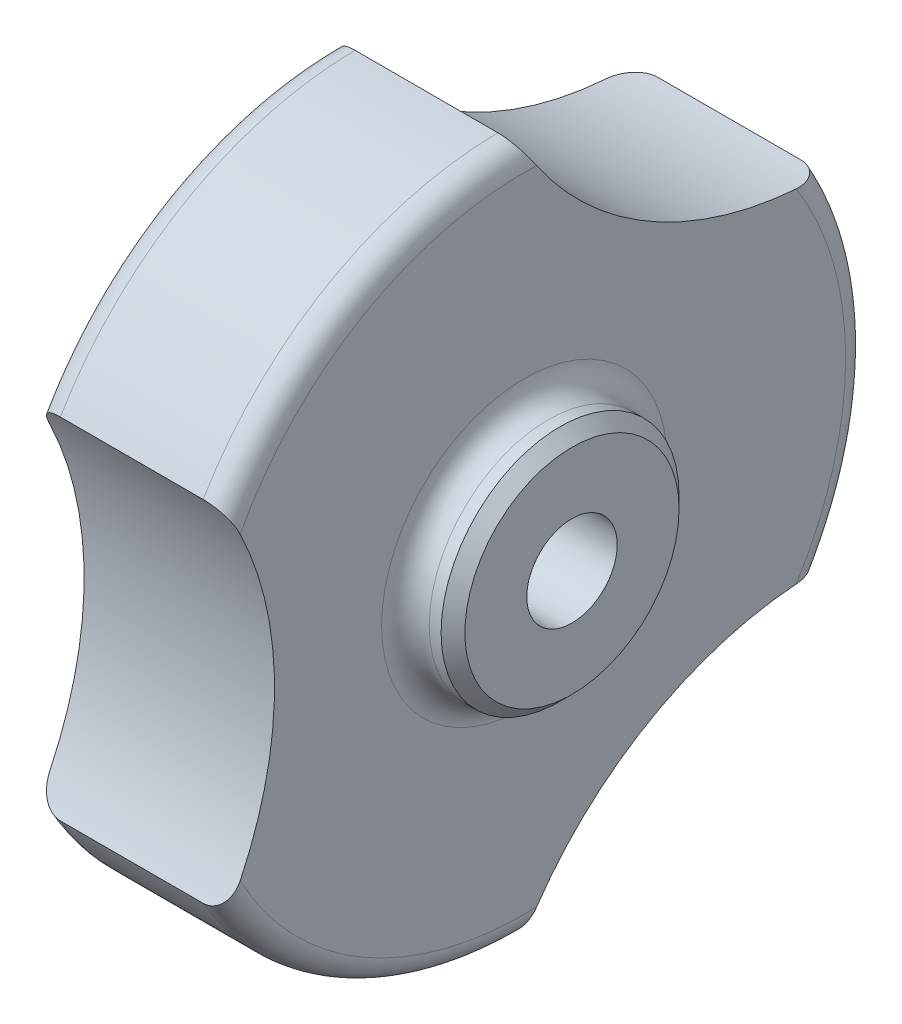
ISO-10303-21;
HEADER;
FILE_DESCRIPTION(('STEP AP214'),'2;1');
FILE_NAME('part.step','',(''),(''),'','','');
FILE_SCHEMA(('AUTOMOTIVE_DESIGN { 1 0 10303 214 1 1 1 1 }'));
ENDSEC;
DATA;
#1=APPLICATION_CONTEXT('core data for automotive mechanical design processes');
#2=APPLICATION_PROTOCOL_DEFINITION('international standard','automotive_design',2000,#1);
#3=PRODUCT_CONTEXT('',#1,'mechanical');
#4=PRODUCT('Part','Part','',(#3));
#5=PRODUCT_RELATED_PRODUCT_CATEGORY('part','',(#4));
#6=PRODUCT_DEFINITION_FORMATION('','',#4);
#7=PRODUCT_DEFINITION_CONTEXT('part definition',#1,'design');
#8=PRODUCT_DEFINITION('design','',#6,#7);
#9=PRODUCT_DEFINITION_SHAPE('','',#8);
#10=(LENGTH_UNIT() NAMED_UNIT(*) SI_UNIT(.MILLI.,.METRE.));
#11=(NAMED_UNIT(*) PLANE_ANGLE_UNIT() SI_UNIT($,.RADIAN.));
#12=(NAMED_UNIT(*) SI_UNIT($,.STERADIAN.) SOLID_ANGLE_UNIT());
#13=UNCERTAINTY_MEASURE_WITH_UNIT(LENGTH_MEASURE(1.E-05),#10,'distance_accuracy_value','');
#14=(GEOMETRIC_REPRESENTATION_CONTEXT(3) GLOBAL_UNCERTAINTY_ASSIGNED_CONTEXT((#13)) GLOBAL_UNIT_ASSIGNED_CONTEXT((#10,
#11,#12)) REPRESENTATION_CONTEXT('',''));
#15=CARTESIAN_POINT('',(0.,0.,0.));
#16=DIRECTION('',(0.,0.,1.));
#17=DIRECTION('',(1.,0.,0.));
#18=AXIS2_PLACEMENT_3D('',#15,#16,#17);
#19=CARTESIAN_POINT('',(8.,14.5,0.));
#20=DIRECTION('',(-1.,0.,0.));
#21=DIRECTION('',(0.,0.,1.));
#22=AXIS2_PLACEMENT_3D('',#19,#20,#21);
#23=PLANE('',#22);
#24=CARTESIAN_POINT('',(8.,0.,0.));
#25=DIRECTION('',(-1.,0.,0.));
#26=DIRECTION('',(0.,0.,1.));
#27=AXIS2_PLACEMENT_3D('',#24,#25,#26);
#28=CIRCLE('',#27,6.);
#29=CARTESIAN_POINT('',(8.,0.,6.));
#30=VERTEX_POINT('',#29);
#31=EDGE_CURVE('E345',#30,#30,#28,.T.);
#32=ORIENTED_EDGE('',*,*,#31,.T.);
#33=EDGE_LOOP('',(#32));
#34=FACE_BOUND('',#33,.T.);
#35=CARTESIAN_POINT('',(8.,0.,0.));
#36=DIRECTION('',(-1.,0.,0.));
#37=DIRECTION('',(0.,0.,1.));
#38=AXIS2_PLACEMENT_3D('',#35,#36,#37);
#39=CIRCLE('',#38,13.5);
#40=CARTESIAN_POINT('',(8.,-6.29971427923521,11.94));
#41=VERTEX_POINT('',#40);
#42=CARTESIAN_POINT('',(8.,-13.4902004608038,-0.514287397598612));
#43=VERTEX_POINT('',#42);
#44=EDGE_CURVE('E235',#41,#43,#39,.F.);
#45=ORIENTED_EDGE('',*,*,#44,.T.);
#46=CARTESIAN_POINT('',(8.,-21.6506350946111,-12.4999999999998));
#47=DIRECTION('',(-1.,0.,0.));
#48=DIRECTION('',(0.,0.,1.));
#49=AXIS2_PLACEMENT_3D('',#46,#47,#48);
#50=CIRCLE('',#49,14.5);
#51=CARTESIAN_POINT('',(8.00000000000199,-7.19048618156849,-11.4257126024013));
#52=VERTEX_POINT('',#51);
#53=EDGE_CURVE('E149',#43,#52,#50,.T.);
#54=ORIENTED_EDGE('',*,*,#53,.T.);
#55=CARTESIAN_POINT('',(8.,7.19048618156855,-11.4257126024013));
#56=VERTEX_POINT('',#55);
#57=EDGE_CURVE('E238',#52,#56,#39,.F.);
#58=ORIENTED_EDGE('',*,*,#57,.T.);
#59=CARTESIAN_POINT('',(8.,21.6506350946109,-12.5000000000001));
#60=DIRECTION('',(-1.,0.,0.));
#61=DIRECTION('',(0.,0.,1.));
#62=AXIS2_PLACEMENT_3D('',#59,#60,#61);
#63=CIRCLE('',#62,14.5);
#64=CARTESIAN_POINT('',(8.,13.4902004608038,-0.514287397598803));
#65=VERTEX_POINT('',#64);
#66=EDGE_CURVE('E299',#56,#65,#63,.T.);
#67=ORIENTED_EDGE('',*,*,#66,.T.);
#68=CARTESIAN_POINT('',(8.,6.29971427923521,11.94));
#69=VERTEX_POINT('',#68);
#70=EDGE_CURVE('E239',#65,#69,#39,.F.);
#71=ORIENTED_EDGE('',*,*,#70,.T.);
#72=CARTESIAN_POINT('',(8.,0.,25.));
#73=DIRECTION('',(-1.,0.,0.));
#74=DIRECTION('',(0.,0.,1.));
#75=AXIS2_PLACEMENT_3D('',#72,#73,#74);
#76=CIRCLE('',#75,14.5);
#77=EDGE_CURVE('E288',#69,#41,#76,.T.);
#78=ORIENTED_EDGE('',*,*,#77,.T.);
#79=EDGE_LOOP('',(#45,#54,#58,#67,#71,#78));
#80=FACE_BOUND('',#79,.T.);
#81=ADVANCED_FACE('F32',(#34,#80),#23,.F.);
#82=CARTESIAN_POINT('',(0.,0.,0.));
#83=DIRECTION('',(-1.,0.,0.));
#84=DIRECTION('',(0.,0.,1.));
#85=AXIS2_PLACEMENT_3D('',#82,#83,#84);
#86=CYLINDRICAL_SURFACE('',#85,14.5);
#87=CARTESIAN_POINT('',(1.,0.,0.));
#88=DIRECTION('',(1.,0.,0.));
#89=DIRECTION('',(0.,0.,-1.));
#90=AXIS2_PLACEMENT_3D('',#87,#88,#89);
#91=CIRCLE('',#90,14.5);
#92=CARTESIAN_POINT('',(1.,-7.34846922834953,12.5));
#93=VERTEX_POINT('',#92);
#94=CARTESIAN_POINT('',(1.,-14.4995521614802,0.113961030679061));
#95=VERTEX_POINT('',#94);
#96=EDGE_CURVE('E257',#93,#95,#91,.T.);
#97=ORIENTED_EDGE('',*,*,#96,.T.);
#98=DIRECTION('',(-1.,0.,0.));
#99=VECTOR('',#98,1.);
#100=CARTESIAN_POINT('',(4.0539386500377,-14.4995521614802,0.113961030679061));
#101=LINE('',#100,#99);
#102=CARTESIAN_POINT('',(6.99999999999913,-14.4995521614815,0.113961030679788));
#103=VERTEX_POINT('',#102);
#104=EDGE_CURVE('E310',#95,#103,#101,.F.);
#105=ORIENTED_EDGE('',*,*,#104,.T.);
#106=CARTESIAN_POINT('',(7.,0.,0.));
#107=DIRECTION('',(-1.,0.,0.));
#108=DIRECTION('',(0.,0.,1.));
#109=AXIS2_PLACEMENT_3D('',#106,#107,#108);
#110=CIRCLE('',#109,14.5);
#111=CARTESIAN_POINT('',(7.,-7.34846922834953,12.5));
#112=VERTEX_POINT('',#111);
#113=EDGE_CURVE('E251',#103,#112,#110,.T.);
#114=ORIENTED_EDGE('',*,*,#113,.T.);
#115=DIRECTION('',(-1.,0.,0.));
#116=VECTOR('',#115,1.);
#117=CARTESIAN_POINT('',(4.,-7.34846922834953,12.5));
#118=LINE('',#117,#116);
#119=EDGE_CURVE('E286',#112,#93,#118,.T.);
#120=ORIENTED_EDGE('',*,*,#119,.T.);
#121=EDGE_LOOP('',(#97,#105,#114,#120));
#122=FACE_BOUND('',#121,.T.);
#123=ADVANCED_FACE('F338',(#122),#86,.T.);
#124=CARTESIAN_POINT('',(7.,0.,0.));
#125=DIRECTION('',(-1.,0.,0.));
#126=DIRECTION('',(0.,0.,1.));
#127=AXIS2_PLACEMENT_3D('',#124,#125,#126);
#128=TOROIDAL_SURFACE('',#127,13.5,1.);
#129=CARTESIAN_POINT('',(6.91709230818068,-12.4351380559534,-1.30515233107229));
#130=CARTESIAN_POINT('',(6.9385392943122,-12.4331712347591,-1.3067718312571));
#131=CARTESIAN_POINT('',(6.96009352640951,-12.4319683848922,-1.30776239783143));
#132=CARTESIAN_POINT('',(7.00324393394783,-12.4310982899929,-1.30847895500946));
#133=CARTESIAN_POINT('',(7.02484008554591,-12.4314303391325,-1.30820552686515));
#134=CARTESIAN_POINT('',(7.08907590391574,-12.4347188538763,-1.30549687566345));
#135=CARTESIAN_POINT('',(7.13155364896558,-12.4399323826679,-1.30120236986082));
#136=CARTESIAN_POINT('',(7.21458214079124,-12.455966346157,-1.28803455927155));
#137=CARTESIAN_POINT('',(7.25513540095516,-12.4667792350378,-1.27916741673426));
#138=CARTESIAN_POINT('',(7.33358066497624,-12.4932568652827,-1.25754849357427));
#139=CARTESIAN_POINT('',(7.37146723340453,-12.5089311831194,-1.24478904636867));
#140=CARTESIAN_POINT('',(7.45722583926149,-12.5507358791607,-1.21094384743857));
#141=CARTESIAN_POINT('',(7.50372189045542,-12.5785959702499,-1.18851740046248));
#142=CARTESIAN_POINT('',(7.59038613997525,-12.639978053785,-1.13955944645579));
#143=CARTESIAN_POINT('',(7.63054088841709,-12.67351177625,-1.1130194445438));
#144=CARTESIAN_POINT('',(7.71739359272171,-12.7572638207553,-1.0474170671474));
#145=CARTESIAN_POINT('',(7.76152942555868,-12.8092346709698,-1.00720442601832));
#146=CARTESIAN_POINT('',(7.83867715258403,-12.9186743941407,-0.923834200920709));
#147=CARTESIAN_POINT('',(7.87168214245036,-12.9761466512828,-0.880674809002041));
#148=CARTESIAN_POINT('',(7.9272097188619,-13.0961878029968,-0.792006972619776));
#149=CARTESIAN_POINT('',(7.9495202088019,-13.1588330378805,-0.746469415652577));
#150=CARTESIAN_POINT('',(7.98245629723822,-13.2868859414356,-0.655005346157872));
#151=CARTESIAN_POINT('',(7.99307664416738,-13.3522948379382,-0.60907866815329));
#152=CARTESIAN_POINT('',(8.00258860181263,-13.492455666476,-0.512415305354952));
#153=CARTESIAN_POINT('',(7.99991259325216,-13.567383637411,-0.461765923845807));
#154=CARTESIAN_POINT('',(7.9780132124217,-13.7164805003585,-0.362984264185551));
#155=CARTESIAN_POINT('',(7.9588131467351,-13.7906503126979,-0.314848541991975));
#156=CARTESIAN_POINT('',(7.91027376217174,-13.9158790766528,-0.235109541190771));
#157=CARTESIAN_POINT('',(7.88495634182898,-13.9678644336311,-0.202499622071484));
#158=CARTESIAN_POINT('',(7.82460172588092,-14.0680217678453,-0.140492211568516));
#159=CARTESIAN_POINT('',(7.78956854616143,-14.116195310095,-0.111093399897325));
#160=CARTESIAN_POINT('',(7.70963168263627,-14.2070922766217,-0.0562660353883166));
#161=CARTESIAN_POINT('',(7.66465350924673,-14.2497705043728,-0.0308700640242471));
#162=CARTESIAN_POINT('',(7.56580599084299,-14.326920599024,0.0146001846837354));
#163=CARTESIAN_POINT('',(7.51194472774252,-14.3613998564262,0.0346792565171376));
#164=CARTESIAN_POINT('',(7.40494111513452,-14.4158926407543,0.066199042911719));
#165=CARTESIAN_POINT('',(7.35271525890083,-14.4372422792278,0.0784472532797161));
#166=CARTESIAN_POINT('',(7.24454993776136,-14.4709572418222,0.0977223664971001));
#167=CARTESIAN_POINT('',(7.18861581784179,-14.4833352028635,0.104756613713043));
#168=CARTESIAN_POINT('',(7.09636744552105,-14.4955627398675,0.111699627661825));
#169=CARTESIAN_POINT('',(7.06053911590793,-14.4983665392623,0.113289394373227));
#170=CARTESIAN_POINT('',(6.98877511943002,-14.5001323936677,0.114289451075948));
#171=CARTESIAN_POINT('',(6.95283951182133,-14.4990962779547,0.113700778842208));
#172=CARTESIAN_POINT('',(6.91709230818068,-14.4961244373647,0.112017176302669));
#173=B_SPLINE_CURVE_WITH_KNOTS('',3,(#129,#130,#131,#132,#133,#134,#135,#136,#137,#138,#139,
#140,#141,#142,#143,#144,#145,#146,#147,#148,#149,#150,#151,#152,#153,#154,#155,#156,#157,#158,
#159,#160,#161,#162,#163,#164,#165,#166,#167,#168,#169,#170,#171,#172),.UNSPECIFIED.,.F.,.F.,(4,
2,2,2,2,2,2,2,2,2,2,2,2,2,2,2,2,2,2,2,2,4),(0.,0.0647499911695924,0.129470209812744,
0.257748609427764,0.385854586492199,0.514214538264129,0.689230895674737,0.864613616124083,
1.10083458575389,1.33720181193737,1.57808047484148,1.81906730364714,2.08909467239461,
2.35874180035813,2.55710945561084,2.75539524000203,2.95521980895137,3.15486356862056,
3.32709842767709,3.49909021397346,3.60675775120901,3.71437400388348),.UNSPECIFIED.);
#174=EDGE_CURVE('E311',#43,#103,#173,.T.);
#175=ORIENTED_EDGE('',*,*,#174,.F.);
#176=ORIENTED_EDGE('',*,*,#44,.F.);
#177=CARTESIAN_POINT('',(6.9998,-7.34846920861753,12.4999999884));
#178=CARTESIAN_POINT('',(7.02522254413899,-7.34847506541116,12.5000039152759));
#179=CARTESIAN_POINT('',(7.05063232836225,-7.34752208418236,12.4994431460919));
#180=CARTESIAN_POINT('',(7.10125349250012,-7.34371718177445,12.4972073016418));
#181=CARTESIAN_POINT('',(7.12646492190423,-7.34086575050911,12.4955325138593));
#182=CARTESIAN_POINT('',(7.2013399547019,-7.32952479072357,12.4888790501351));
#183=CARTESIAN_POINT('',(7.25047289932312,-7.31824824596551,12.4822710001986));
#184=CARTESIAN_POINT('',(7.34578809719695,-7.2887301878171,12.4650608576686));
#185=CARTESIAN_POINT('',(7.39197183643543,-7.2704922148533,12.4544607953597));
#186=CARTESIAN_POINT('',(7.48035298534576,-7.22774892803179,12.4297870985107));
#187=CARTESIAN_POINT('',(7.52254818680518,-7.20324016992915,12.4157115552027));
#188=CARTESIAN_POINT('',(7.60372094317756,-7.14769816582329,12.3840787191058));
#189=CARTESIAN_POINT('',(7.6424973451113,-7.11643976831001,12.3664029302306));
#190=CARTESIAN_POINT('',(7.71423588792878,-7.0490726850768,12.32869128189));
#191=CARTESIAN_POINT('',(7.74719588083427,-7.01296221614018,12.3086545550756));
#192=CARTESIAN_POINT('',(7.81051478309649,-6.93242773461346,12.2644674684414));
#193=CARTESIAN_POINT('',(7.84011893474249,-6.88752534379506,12.2401100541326));
#194=CARTESIAN_POINT('',(7.89165657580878,-6.79416868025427,12.1901568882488));
#195=CARTESIAN_POINT('',(7.9135862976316,-6.74571267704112,12.1645605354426));
#196=CARTESIAN_POINT('',(7.95275862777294,-6.63863486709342,12.1088129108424));
#197=CARTESIAN_POINT('',(7.96874662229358,-6.57960204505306,12.0785709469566));
#198=CARTESIAN_POINT('',(7.99114794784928,-6.45970330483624,12.0182146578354));
#199=CARTESIAN_POINT('',(7.9975564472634,-6.39883647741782,11.9881004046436));
#200=CARTESIAN_POINT('',(8.00160114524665,-6.26623859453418,11.9236647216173));
#201=CARTESIAN_POINT('',(7.99759486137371,-6.19438967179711,11.889479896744));
#202=CARTESIAN_POINT('',(7.97787804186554,-6.05141285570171,11.8228743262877));
#203=CARTESIAN_POINT('',(7.96215276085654,-5.98028598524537,11.7904558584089));
#204=CARTESIAN_POINT('',(7.916831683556,-5.83194126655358,11.7242393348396));
#205=CARTESIAN_POINT('',(7.88579136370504,-5.75502383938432,11.6907466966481));
#206=CARTESIAN_POINT('',(7.80962762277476,-5.60675313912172,11.6276112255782));
#207=CARTESIAN_POINT('',(7.76452180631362,-5.5353930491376,11.5979636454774));
#208=CARTESIAN_POINT('',(7.67718048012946,-5.42399860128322,11.5525991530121));
#209=CARTESIAN_POINT('',(7.63891252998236,-5.38139947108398,11.5355143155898));
#210=CARTESIAN_POINT('',(7.55575929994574,-5.30202692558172,11.5040628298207));
#211=CARTESIAN_POINT('',(7.51088431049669,-5.26524463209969,11.4896920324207));
#212=CARTESIAN_POINT('',(7.42526882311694,-5.2069640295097,11.4671406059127));
#213=CARTESIAN_POINT('',(7.38578633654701,-5.18388325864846,11.4582936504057));
#214=CARTESIAN_POINT('',(7.30337322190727,-5.14401574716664,11.443099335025));
#215=CARTESIAN_POINT('',(7.26045220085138,-5.12721216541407,11.4367452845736));
#216=CARTESIAN_POINT('',(7.18138551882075,-5.10394573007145,11.4279748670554));
#217=CARTESIAN_POINT('',(7.14572317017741,-5.09604851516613,11.4250103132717));
#218=CARTESIAN_POINT('',(7.07333076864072,-5.08536784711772,11.4210072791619));
#219=CARTESIAN_POINT('',(7.03659571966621,-5.08261434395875,11.419980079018));
#220=CARTESIAN_POINT('',(6.9998,-5.08267648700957,11.42000001));
#221=B_SPLINE_CURVE_WITH_KNOTS('',3,(#177,#178,#179,#180,#181,#182,#183,#184,#185,#186,#187,
#188,#189,#190,#191,#192,#193,#194,#195,#196,#197,#198,#199,#200,#201,#202,#203,#204,#205,#206,
#207,#208,#209,#210,#211,#212,#213,#214,#215,#216,#217,#218,#219,#220),.UNSPECIFIED.,.F.,.F.,(4,
2,2,2,2,2,2,2,2,2,2,2,2,2,2,2,2,2,2,2,2,4),(0.,0.0762178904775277,0.152416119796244,
0.304136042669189,0.455778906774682,0.607505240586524,0.765413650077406,0.923380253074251,
1.0998173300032,1.27634090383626,1.48024483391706,1.6842515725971,1.92230465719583,
2.16065777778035,2.42776701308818,2.69454326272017,2.8732562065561,3.05169369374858,
3.19092469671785,3.32977942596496,3.43931100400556,3.54947838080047),.UNSPECIFIED.);
#222=EDGE_CURVE('E269',#112,#41,#221,.T.);
#223=ORIENTED_EDGE('',*,*,#222,.F.);
#224=ORIENTED_EDGE('',*,*,#113,.F.);
#225=EDGE_LOOP('',(#175,#176,#223,#224));
#226=FACE_BOUND('',#225,.T.);
#227=ADVANCED_FACE('F334',(#226),#128,.T.);
#228=CARTESIAN_POINT('',(1.,0.,0.));
#229=DIRECTION('',(1.,0.,0.));
#230=DIRECTION('',(0.,0.,-1.));
#231=AXIS2_PLACEMENT_3D('',#228,#229,#230);
#232=TOROIDAL_SURFACE('',#231,13.5,1.);
#233=CARTESIAN_POINT('',(1.10807730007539,-14.4937201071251,0.110652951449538));
#234=CARTESIAN_POINT('',(1.0832466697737,-14.4964090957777,0.112178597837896));
#235=CARTESIAN_POINT('',(1.05829508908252,-14.4981706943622,0.113177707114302));
#236=CARTESIAN_POINT('',(1.00831347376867,-14.4998290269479,0.114118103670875));
#237=CARTESIAN_POINT('',(0.983283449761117,-14.4997260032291,0.11405952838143));
#238=CARTESIAN_POINT('',(0.908493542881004,-14.4966131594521,0.112294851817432));
#239=CARTESIAN_POINT('',(0.858850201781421,-14.4908192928,0.109010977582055));
#240=CARTESIAN_POINT('',(0.761426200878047,-14.472060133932,0.0983401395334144));
#241=CARTESIAN_POINT('',(0.713645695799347,-14.4590942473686,0.0909528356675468));
#242=CARTESIAN_POINT('',(0.621169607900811,-14.4265856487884,0.0723290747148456));
#243=CARTESIAN_POINT('',(0.576474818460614,-14.4070412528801,0.0610916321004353));
#244=CARTESIAN_POINT('',(0.490132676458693,-14.3616346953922,0.0347985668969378));
#245=CARTESIAN_POINT('',(0.448589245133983,-14.3356270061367,0.0196546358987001));
#246=CARTESIAN_POINT('',(0.3705824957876,-14.2785733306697,-0.0138557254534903));
#247=CARTESIAN_POINT('',(0.334121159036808,-14.2475253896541,-0.0322234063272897));
#248=CARTESIAN_POINT('',(0.263484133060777,-14.1782193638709,-0.0736255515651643));
#249=CARTESIAN_POINT('',(0.22987360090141,-14.139553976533,-0.0969399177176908));
#250=CARTESIAN_POINT('',(0.169608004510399,-14.0587057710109,-0.146261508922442));
#251=CARTESIAN_POINT('',(0.142955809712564,-14.0165215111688,-0.172269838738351));
#252=CARTESIAN_POINT('',(0.0933142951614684,-13.9236088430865,-0.230262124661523));
#253=CARTESIAN_POINT('',(0.0713836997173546,-13.8725181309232,-0.262570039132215));
#254=CARTESIAN_POINT('',(0.0363386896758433,-13.7686706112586,-0.329196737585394));
#255=CARTESIAN_POINT('',(0.0232290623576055,-13.7159129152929,-0.363516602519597));
#256=CARTESIAN_POINT('',(0.0039514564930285,-13.6010174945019,-0.4393556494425));
#257=CARTESIAN_POINT('',(-0.000690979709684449,-13.5387851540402,-0.481119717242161));
#258=CARTESIAN_POINT('',(0.000857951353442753,-13.4150569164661,-0.565559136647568));
#259=CARTESIAN_POINT('',(0.0070587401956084,-13.3535617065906,-0.608235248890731));
#260=CARTESIAN_POINT('',(0.0314661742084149,-13.2235003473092,-0.699973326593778));
#261=CARTESIAN_POINT('',(0.0513221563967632,-13.1552438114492,-0.749040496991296));
#262=CARTESIAN_POINT('',(0.104209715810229,-13.0229549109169,-0.845822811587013));
#263=CARTESIAN_POINT('',(0.137241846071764,-12.9589227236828,-0.893537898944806));
#264=CARTESIAN_POINT('',(0.209185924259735,-12.8482484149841,-0.977331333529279));
#265=CARTESIAN_POINT('',(0.245899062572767,-12.8005739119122,-1.01393586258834));
#266=CARTESIAN_POINT('',(0.328329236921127,-12.7107742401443,-1.08369146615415));
#267=CARTESIAN_POINT('',(0.374032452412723,-12.6686407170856,-1.11684772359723));
#268=CARTESIAN_POINT('',(0.461097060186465,-12.6023018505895,-1.16955612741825));
#269=CARTESIAN_POINT('',(0.500334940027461,-12.5763190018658,-1.19037182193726));
#270=CARTESIAN_POINT('',(0.583580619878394,-12.5296114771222,-1.22800704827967));
#271=CARTESIAN_POINT('',(0.627580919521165,-12.508878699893,-1.24483273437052));
#272=CARTESIAN_POINT('',(0.711578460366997,-12.4771236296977,-1.27070646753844));
#273=CARTESIAN_POINT('',(0.750906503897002,-12.4650322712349,-1.28060390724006));
#274=CARTESIAN_POINT('',(0.831611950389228,-12.446116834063,-1.29611697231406));
#275=CARTESIAN_POINT('',(0.872986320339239,-12.4392851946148,-1.30173874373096));
#276=CARTESIAN_POINT('',(0.946848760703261,-12.4323353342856,-1.30745928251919));
#277=CARTESIAN_POINT('',(0.979154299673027,-12.4310214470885,-1.30854161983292));
#278=CARTESIAN_POINT('',(1.04377711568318,-12.4318199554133,-1.30788530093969));
#279=CARTESIAN_POINT('',(1.07609420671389,-12.4339412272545,-1.30613933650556));
#280=CARTESIAN_POINT('',(1.10807730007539,-12.4377953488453,-1.30296540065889));
#281=B_SPLINE_CURVE_WITH_KNOTS('',3,(#233,#234,#235,#236,#237,#238,#239,#240,#241,#242,#243,
#244,#245,#246,#247,#248,#249,#250,#251,#252,#253,#254,#255,#256,#257,#258,#259,#260,#261,#262,
#263,#264,#265,#266,#267,#268,#269,#270,#271,#272,#273,#274,#275,#276,#277,#278,#279,#280),
.UNSPECIFIED.,.F.,.F.,(4,2,2,2,2,2,2,2,2,2,2,2,2,2,2,2,2,2,2,2,2,2,2,4),(0.,0.0750206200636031,
0.150031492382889,0.29950551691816,0.44899193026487,0.598516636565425,0.751773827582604,
0.905090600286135,1.07328539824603,1.24154944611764,1.43372467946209,1.626004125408,
1.85040566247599,2.07500227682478,2.33302240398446,2.59105336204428,2.80162683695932,
3.0118790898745,3.16573647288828,3.31935497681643,3.44579291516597,3.57204876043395,
3.66880381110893,3.76580927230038),.UNSPECIFIED.);
#282=CARTESIAN_POINT('',(0.,-13.4902004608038,-0.514287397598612));
#283=VERTEX_POINT('',#282);
#284=EDGE_CURVE('E174',#95,#283,#281,.T.);
#285=ORIENTED_EDGE('',*,*,#284,.F.);
#286=ORIENTED_EDGE('',*,*,#96,.F.);
#287=CARTESIAN_POINT('',(1.0002,-5.08267648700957,11.42000001));
#288=CARTESIAN_POINT('',(0.977538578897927,-5.08266507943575,11.4199961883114));
#289=CARTESIAN_POINT('',(0.954891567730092,-5.08369436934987,11.4203809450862));
#290=CARTESIAN_POINT('',(0.909827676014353,-5.08777610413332,11.42190949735));
#291=CARTESIAN_POINT('',(0.887410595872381,-5.09082661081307,11.4230525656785));
#292=CARTESIAN_POINT('',(0.821206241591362,-5.10284125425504,11.4275615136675));
#293=CARTESIAN_POINT('',(0.777983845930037,-5.11467110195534,11.432007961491));
#294=CARTESIAN_POINT('',(0.69452382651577,-5.14492065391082,11.4434500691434));
#295=CARTESIAN_POINT('',(0.654276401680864,-5.16331743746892,11.450436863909));
#296=CARTESIAN_POINT('',(0.577108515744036,-5.20551940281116,11.4665938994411));
#297=CARTESIAN_POINT('',(0.540197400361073,-5.22933915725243,11.4757700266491));
#298=CARTESIAN_POINT('',(0.454230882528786,-5.29294366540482,11.5005049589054));
#299=CARTESIAN_POINT('',(0.4072101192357,-5.33508263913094,11.5170755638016));
#300=CARTESIAN_POINT('',(0.320986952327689,-5.42558526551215,11.5532377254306));
#301=CARTESIAN_POINT('',(0.281799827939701,-5.47396078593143,11.5728350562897));
#302=CARTESIAN_POINT('',(0.200338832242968,-5.59037071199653,11.620806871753));
#303=CARTESIAN_POINT('',(0.160731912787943,-5.65991834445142,11.6500409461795));
#304=CARTESIAN_POINT('',(0.0942731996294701,-5.80343742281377,11.7118008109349));
#305=CARTESIAN_POINT('',(0.0674267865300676,-5.87741072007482,11.7443279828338));
#306=CARTESIAN_POINT('',(0.0264470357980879,-6.02848968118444,11.8123451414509));
#307=CARTESIAN_POINT('',(0.0124501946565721,-6.10562008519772,11.8478626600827));
#308=CARTESIAN_POINT('',(-0.00171006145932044,-6.26031931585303,11.9207907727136));
#309=CARTESIAN_POINT('',(-0.00186886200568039,-6.33788828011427,11.9582019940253));
#310=CARTESIAN_POINT('',(0.0128265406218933,-6.49386040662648,12.035140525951));
#311=CARTESIAN_POINT('',(0.0281829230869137,-6.5722047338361,12.0746967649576));
#312=CARTESIAN_POINT('',(0.0757745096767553,-6.72400756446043,12.1530169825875));
#313=CARTESIAN_POINT('',(0.107974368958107,-6.79747593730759,12.1917824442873));
#314=CARTESIAN_POINT('',(0.177033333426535,-6.91433081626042,12.2546088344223));
#315=CARTESIAN_POINT('',(0.209346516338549,-6.95997789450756,12.279500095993));
#316=CARTESIAN_POINT('',(0.282093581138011,-7.04577084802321,12.3268195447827));
#317=CARTESIAN_POINT('',(0.322521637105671,-7.08592063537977,12.3492494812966));
#318=CARTESIAN_POINT('',(0.411246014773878,-7.15942135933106,12.3906984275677));
#319=CARTESIAN_POINT('',(0.459594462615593,-7.19272371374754,12.4096929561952));
#320=CARTESIAN_POINT('',(0.562725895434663,-7.25056255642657,12.442911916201));
#321=CARTESIAN_POINT('',(0.617502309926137,-7.27510789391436,12.4571411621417));
#322=CARTESIAN_POINT('',(0.726173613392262,-7.31222687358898,12.4787476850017));
#323=CARTESIAN_POINT('',(0.779642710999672,-7.32572778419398,12.486653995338));
#324=CARTESIAN_POINT('',(0.861406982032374,-7.3393295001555,12.494630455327));
#325=CARTESIAN_POINT('',(0.889003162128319,-7.34275530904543,12.4966422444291));
#326=CARTESIAN_POINT('',(0.944460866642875,-7.34732927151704,12.499329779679));
#327=CARTESIAN_POINT('',(0.972322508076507,-7.34847636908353,12.5000049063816));
#328=CARTESIAN_POINT('',(1.0002,-7.34846920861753,12.4999999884));
#329=B_SPLINE_CURVE_WITH_KNOTS('',3,(#287,#288,#289,#290,#291,#292,#293,#294,#295,#296,#297,
#298,#299,#300,#301,#302,#303,#304,#305,#306,#307,#308,#309,#310,#311,#312,#313,#314,#315,#316,
#317,#318,#319,#320,#321,#322,#323,#324,#325,#326,#327,#328),.UNSPECIFIED.,.F.,.F.,(4,2,2,2,2,2,
2,2,2,2,2,2,2,2,2,2,2,2,2,2,4),(0.,0.0679297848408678,0.135794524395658,0.270101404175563,
0.403944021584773,0.538150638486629,0.732909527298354,0.928044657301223,1.18234826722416,
1.43675901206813,1.69384201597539,1.95101074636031,2.21677863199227,2.48199104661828,
2.66491063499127,2.84769936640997,3.03174333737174,3.21560079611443,3.38170146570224,
3.46523178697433,3.5488008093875),.UNSPECIFIED.);
#330=CARTESIAN_POINT('',(0.,-6.29971427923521,11.94));
#331=VERTEX_POINT('',#330);
#332=EDGE_CURVE('E192',#331,#93,#329,.T.);
#333=ORIENTED_EDGE('',*,*,#332,.F.);
#334=CARTESIAN_POINT('',(0.,0.,0.));
#335=DIRECTION('',(1.,0.,0.));
#336=DIRECTION('',(0.,0.,-1.));
#337=AXIS2_PLACEMENT_3D('',#334,#335,#336);
#338=CIRCLE('',#337,13.5);
#339=EDGE_CURVE('E230',#283,#331,#338,.F.);
#340=ORIENTED_EDGE('',*,*,#339,.F.);
#341=EDGE_LOOP('',(#285,#286,#333,#340));
#342=FACE_BOUND('',#341,.T.);
#343=ADVANCED_FACE('F186',(#342),#232,.T.);
#344=CARTESIAN_POINT('',(7.,7.15108293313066,-12.613961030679));
#345=VERTEX_POINT('',#344);
#346=CARTESIAN_POINT('',(7.,-7.15108293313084,-12.6139610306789));
#347=VERTEX_POINT('',#346);
#348=EDGE_CURVE('E250',#345,#347,#110,.T.);
#349=ORIENTED_EDGE('',*,*,#348,.T.);
#350=DIRECTION('',(-1.,0.,0.));
#351=VECTOR('',#350,1.);
#352=CARTESIAN_POINT('',(4.0539386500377,-7.15108293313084,-12.6139610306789));
#353=LINE('',#352,#351);
#354=CARTESIAN_POINT('',(1.,-7.15108293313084,-12.6139610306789));
#355=VERTEX_POINT('',#354);
#356=EDGE_CURVE('E136',#347,#355,#353,.T.);
#357=ORIENTED_EDGE('',*,*,#356,.T.);
#358=CARTESIAN_POINT('',(1.,7.15108293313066,-12.613961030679));
#359=VERTEX_POINT('',#358);
#360=EDGE_CURVE('E55',#355,#359,#91,.T.);
#361=ORIENTED_EDGE('',*,*,#360,.T.);
#362=DIRECTION('',(-1.,0.,0.));
#363=VECTOR('',#362,1.);
#364=CARTESIAN_POINT('',(4.0539386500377,7.15108293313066,-12.613961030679));
#365=LINE('',#364,#363);
#366=EDGE_CURVE('E306',#359,#345,#365,.F.);
#367=ORIENTED_EDGE('',*,*,#366,.T.);
#368=EDGE_LOOP('',(#349,#357,#361,#367));
#369=FACE_BOUND('',#368,.T.);
#370=ADVANCED_FACE('F322',(#369),#86,.T.);
#371=CARTESIAN_POINT('',(6.89192269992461,14.4937201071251,0.110652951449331));
#372=CARTESIAN_POINT('',(6.91675333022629,14.4964090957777,0.11217859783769));
#373=CARTESIAN_POINT('',(6.94170491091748,14.4981706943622,0.113177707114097));
#374=CARTESIAN_POINT('',(6.99168652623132,14.4998290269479,0.114118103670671));
#375=CARTESIAN_POINT('',(7.01671655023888,14.4997260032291,0.114059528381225));
#376=CARTESIAN_POINT('',(7.09150645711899,14.4966131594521,0.112294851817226));
#377=CARTESIAN_POINT('',(7.14114979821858,14.4908192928,0.109010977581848));
#378=CARTESIAN_POINT('',(7.23857379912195,14.472060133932,0.0983401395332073));
#379=CARTESIAN_POINT('',(7.28635430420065,14.4590942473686,0.0909528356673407));
#380=CARTESIAN_POINT('',(7.37883039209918,14.4265856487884,0.0723290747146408));
#381=CARTESIAN_POINT('',(7.42352518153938,14.4070412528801,0.0610916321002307));
#382=CARTESIAN_POINT('',(7.5098673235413,14.3616346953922,0.0347985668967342));
#383=CARTESIAN_POINT('',(7.55141075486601,14.3356270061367,0.0196546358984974));
#384=CARTESIAN_POINT('',(7.6294175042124,14.2785733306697,-0.0138557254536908));
#385=CARTESIAN_POINT('',(7.66587884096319,14.2475253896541,-0.0322234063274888));
#386=CARTESIAN_POINT('',(7.73651586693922,14.1782193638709,-0.0736255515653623));
#387=CARTESIAN_POINT('',(7.77012639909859,14.139553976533,-0.0969399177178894));
#388=CARTESIAN_POINT('',(7.8303919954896,14.0587057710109,-0.14626150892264));
#389=CARTESIAN_POINT('',(7.85704419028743,14.0165215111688,-0.172269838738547));
#390=CARTESIAN_POINT('',(7.90668570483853,13.9236088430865,-0.230262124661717));
#391=CARTESIAN_POINT('',(7.92861630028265,13.8725181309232,-0.262570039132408));
#392=CARTESIAN_POINT('',(7.96366131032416,13.7686706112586,-0.329196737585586));
#393=CARTESIAN_POINT('',(7.97677093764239,13.7159129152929,-0.363516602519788));
#394=CARTESIAN_POINT('',(7.99604854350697,13.6010174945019,-0.43935564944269));
#395=CARTESIAN_POINT('',(8.00069097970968,13.5387851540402,-0.48111971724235));
#396=CARTESIAN_POINT('',(7.99914204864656,13.4150569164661,-0.565559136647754));
#397=CARTESIAN_POINT('',(7.99294125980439,13.3535617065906,-0.608235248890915));
#398=CARTESIAN_POINT('',(7.96853382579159,13.2235003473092,-0.699973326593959));
#399=CARTESIAN_POINT('',(7.94867784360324,13.1552438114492,-0.749040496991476));
#400=CARTESIAN_POINT('',(7.89579028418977,13.0229549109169,-0.845822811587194));
#401=CARTESIAN_POINT('',(7.86275815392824,12.9589227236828,-0.893537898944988));
#402=CARTESIAN_POINT('',(7.79081407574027,12.8482484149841,-0.97733133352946));
#403=CARTESIAN_POINT('',(7.75410093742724,12.8005739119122,-1.01393586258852));
#404=CARTESIAN_POINT('',(7.67167076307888,12.7107742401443,-1.08369146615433));
#405=CARTESIAN_POINT('',(7.62596754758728,12.6686407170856,-1.1168477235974));
#406=CARTESIAN_POINT('',(7.53890293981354,12.6023018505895,-1.16955612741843));
#407=CARTESIAN_POINT('',(7.49966505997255,12.5763190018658,-1.19037182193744));
#408=CARTESIAN_POINT('',(7.41641938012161,12.5296114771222,-1.22800704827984));
#409=CARTESIAN_POINT('',(7.37241908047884,12.508878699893,-1.2448327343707));
#410=CARTESIAN_POINT('',(7.28842153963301,12.4771236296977,-1.27070646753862));
#411=CARTESIAN_POINT('',(7.249093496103,12.4650322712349,-1.28060390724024));
#412=CARTESIAN_POINT('',(7.16838804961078,12.446116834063,-1.29611697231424));
#413=CARTESIAN_POINT('',(7.12701367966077,12.4392851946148,-1.30173874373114));
#414=CARTESIAN_POINT('',(7.05315123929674,12.4323353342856,-1.30745928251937));
#415=CARTESIAN_POINT('',(7.02084570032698,12.4310214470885,-1.3085416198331));
#416=CARTESIAN_POINT('',(6.95622288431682,12.4318199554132,-1.30788530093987));
#417=CARTESIAN_POINT('',(6.9239057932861,12.4339412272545,-1.30613933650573));
#418=CARTESIAN_POINT('',(6.89192269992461,12.4377953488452,-1.30296540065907));
#419=B_SPLINE_CURVE_WITH_KNOTS('',3,(#371,#372,#373,#374,#375,#376,#377,#378,#379,#380,#381,
#382,#383,#384,#385,#386,#387,#388,#389,#390,#391,#392,#393,#394,#395,#396,#397,#398,#399,#400,
#401,#402,#403,#404,#405,#406,#407,#408,#409,#410,#411,#412,#413,#414,#415,#416,#417,#418),
.UNSPECIFIED.,.F.,.F.,(4,2,2,2,2,2,2,2,2,2,2,2,2,2,2,2,2,2,2,2,2,2,2,4),(0.,0.0750206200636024,
0.150031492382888,0.29950551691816,0.44899193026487,0.598516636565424,0.751773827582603,
0.905090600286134,1.07328539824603,1.24154944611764,1.43372467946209,1.626004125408,
1.85040566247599,2.07500227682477,2.33302240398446,2.59105336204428,2.80162683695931,
3.0118790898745,3.16573647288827,3.31935497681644,3.44579291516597,3.57204876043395,
3.66880381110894,3.76580927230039),.UNSPECIFIED.);
#420=CARTESIAN_POINT('',(7.,14.4995521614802,0.113961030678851));
#421=VERTEX_POINT('',#420);
#422=EDGE_CURVE('E294',#421,#65,#419,.T.);
#423=ORIENTED_EDGE('',*,*,#422,.F.);
#424=CARTESIAN_POINT('',(7.,7.34846922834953,12.5));
#425=VERTEX_POINT('',#424);
#426=EDGE_CURVE('E245',#425,#421,#110,.T.);
#427=ORIENTED_EDGE('',*,*,#426,.F.);
#428=CARTESIAN_POINT('',(6.9998,5.08267648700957,11.42000001));
#429=CARTESIAN_POINT('',(7.02246142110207,5.08266507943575,11.4199961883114));
#430=CARTESIAN_POINT('',(7.04510843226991,5.08369436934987,11.4203809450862));
#431=CARTESIAN_POINT('',(7.09017232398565,5.08777610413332,11.42190949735));
#432=CARTESIAN_POINT('',(7.11258940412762,5.09082661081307,11.4230525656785));
#433=CARTESIAN_POINT('',(7.17879375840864,5.10284125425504,11.4275615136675));
#434=CARTESIAN_POINT('',(7.22201615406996,5.11467110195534,11.432007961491));
#435=CARTESIAN_POINT('',(7.30547617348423,5.14492065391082,11.4434500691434));
#436=CARTESIAN_POINT('',(7.34572359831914,5.16331743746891,11.450436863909));
#437=CARTESIAN_POINT('',(7.42289148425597,5.20551940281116,11.4665938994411));
#438=CARTESIAN_POINT('',(7.45980259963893,5.22933915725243,11.4757700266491));
#439=CARTESIAN_POINT('',(7.54576911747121,5.29294366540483,11.5005049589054));
#440=CARTESIAN_POINT('',(7.5927898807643,5.33508263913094,11.5170755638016));
#441=CARTESIAN_POINT('',(7.67901304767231,5.42558526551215,11.5532377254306));
#442=CARTESIAN_POINT('',(7.7182001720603,5.47396078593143,11.5728350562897));
#443=CARTESIAN_POINT('',(7.79966116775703,5.59037071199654,11.620806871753));
#444=CARTESIAN_POINT('',(7.83926808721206,5.65991834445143,11.6500409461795));
#445=CARTESIAN_POINT('',(7.90572680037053,5.80343742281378,11.7118008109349));
#446=CARTESIAN_POINT('',(7.93257321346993,5.87741072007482,11.7443279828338));
#447=CARTESIAN_POINT('',(7.97355296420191,6.02848968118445,11.8123451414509));
#448=CARTESIAN_POINT('',(7.98754980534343,6.10562008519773,11.8478626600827));
#449=CARTESIAN_POINT('',(8.00171006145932,6.26031931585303,11.9207907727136));
#450=CARTESIAN_POINT('',(8.00186886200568,6.33788828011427,11.9582019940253));
#451=CARTESIAN_POINT('',(7.98717345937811,6.49386040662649,12.035140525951));
#452=CARTESIAN_POINT('',(7.97181707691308,6.5722047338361,12.0746967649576));
#453=CARTESIAN_POINT('',(7.92422549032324,6.72400756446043,12.1530169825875));
#454=CARTESIAN_POINT('',(7.89202563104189,6.79747593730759,12.1917824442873));
#455=CARTESIAN_POINT('',(7.82296666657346,6.91433081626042,12.2546088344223));
#456=CARTESIAN_POINT('',(7.79065348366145,6.95997789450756,12.279500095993));
#457=CARTESIAN_POINT('',(7.71790641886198,7.04577084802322,12.3268195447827));
#458=CARTESIAN_POINT('',(7.67747836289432,7.08592063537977,12.3492494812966));
#459=CARTESIAN_POINT('',(7.58875398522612,7.15942135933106,12.3906984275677));
#460=CARTESIAN_POINT('',(7.5404055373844,7.19272371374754,12.4096929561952));
#461=CARTESIAN_POINT('',(7.43727410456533,7.25056255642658,12.442911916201));
#462=CARTESIAN_POINT('',(7.38249769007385,7.27510789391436,12.4571411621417));
#463=CARTESIAN_POINT('',(7.27382638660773,7.31222687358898,12.4787476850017));
#464=CARTESIAN_POINT('',(7.22035728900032,7.32572778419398,12.486653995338));
#465=CARTESIAN_POINT('',(7.13859301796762,7.3393295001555,12.494630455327));
#466=CARTESIAN_POINT('',(7.11099683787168,7.34275530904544,12.4966422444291));
#467=CARTESIAN_POINT('',(7.05553913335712,7.34732927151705,12.499329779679));
#468=CARTESIAN_POINT('',(7.02767749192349,7.34847636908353,12.5000049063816));
#469=CARTESIAN_POINT('',(6.9998,7.34846920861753,12.4999999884));
#470=B_SPLINE_CURVE_WITH_KNOTS('',3,(#428,#429,#430,#431,#432,#433,#434,#435,#436,#437,#438,
#439,#440,#441,#442,#443,#444,#445,#446,#447,#448,#449,#450,#451,#452,#453,#454,#455,#456,#457,
#458,#459,#460,#461,#462,#463,#464,#465,#466,#467,#468,#469),.UNSPECIFIED.,.F.,.F.,(4,2,2,2,2,2,
2,2,2,2,2,2,2,2,2,2,2,2,2,2,4),(0.,0.0679297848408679,0.135794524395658,0.270101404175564,
0.403944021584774,0.538150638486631,0.732909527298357,0.928044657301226,1.18234826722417,
1.43675901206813,1.6938420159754,1.95101074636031,2.21677863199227,2.48199104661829,
2.66491063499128,2.84769936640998,3.03174333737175,3.21560079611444,3.38170146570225,
3.46523178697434,3.5488008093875),.UNSPECIFIED.);
#471=EDGE_CURVE('E265',#69,#425,#470,.T.);
#472=ORIENTED_EDGE('',*,*,#471,.F.);
#473=ORIENTED_EDGE('',*,*,#70,.F.);
#474=EDGE_LOOP('',(#423,#427,#472,#473));
#475=FACE_BOUND('',#474,.T.);
#476=ADVANCED_FACE('F327',(#475),#128,.T.);
#477=CARTESIAN_POINT('',(1.10807730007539,12.4377953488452,-1.30296540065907));
#478=CARTESIAN_POINT('',(1.08698612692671,12.4352696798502,-1.3050438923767));
#479=CARTESIAN_POINT('',(1.06575634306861,12.4334802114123,-1.30651725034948));
#480=CARTESIAN_POINT('',(1.0231809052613,12.4313945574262,-1.30823484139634));
#481=CARTESIAN_POINT('',(1.00183528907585,12.4310979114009,-1.30847945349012));
#482=CARTESIAN_POINT('',(0.938203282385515,12.4324691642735,-1.30734960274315));
#483=CARTESIAN_POINT('',(0.895964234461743,12.4363555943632,-1.30414661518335));
#484=CARTESIAN_POINT('',(0.813088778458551,12.4497523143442,-1.29313484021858));
#485=CARTESIAN_POINT('',(0.772451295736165,12.4592587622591,-1.28532919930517));
#486=CARTESIAN_POINT('',(0.693627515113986,12.4832058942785,-1.26574522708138));
#487=CARTESIAN_POINT('',(0.655445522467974,12.4976549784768,-1.25396013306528));
#488=CARTESIAN_POINT('',(0.569876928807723,12.5362129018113,-1.22267289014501));
#489=CARTESIAN_POINT('',(0.523683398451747,12.5619362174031,-1.20190802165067));
#490=CARTESIAN_POINT('',(0.43720217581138,12.6190167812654,-1.15622577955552));
#491=CARTESIAN_POINT('',(0.396927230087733,12.6503858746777,-1.13129968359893));
#492=CARTESIAN_POINT('',(0.309127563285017,12.7292742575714,-1.06922421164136));
#493=CARTESIAN_POINT('',(0.264069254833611,12.7785837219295,-1.03086780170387));
#494=CARTESIAN_POINT('',(0.184543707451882,12.8827777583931,-0.951017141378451));
#495=CARTESIAN_POINT('',(0.150083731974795,12.9376661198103,-0.909520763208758));
#496=CARTESIAN_POINT('',(0.0909551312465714,13.0527221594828,-0.823907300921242));
#497=CARTESIAN_POINT('',(0.0665122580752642,13.1129777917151,-0.77975310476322));
#498=CARTESIAN_POINT('',(0.0286503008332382,13.236432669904,-0.690808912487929));
#499=CARTESIAN_POINT('',(0.0152358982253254,13.2996331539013,-0.646018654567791));
#500=CARTESIAN_POINT('',(-0.00123008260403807,13.4371635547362,-0.550234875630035));
#501=CARTESIAN_POINT('',(-0.00246499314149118,13.5117619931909,-0.499299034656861));
#502=CARTESIAN_POINT('',(0.0112731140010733,13.6608730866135,-0.399515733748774));
#503=CARTESIAN_POINT('',(0.0262278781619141,13.7353857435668,-0.350665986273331));
#504=CARTESIAN_POINT('',(0.0676609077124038,13.8635473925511,-0.268254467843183));
#505=CARTESIAN_POINT('',(0.0904501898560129,13.9178616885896,-0.233864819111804));
#506=CARTESIAN_POINT('',(0.146252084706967,14.0230580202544,-0.1681752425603));
#507=CARTESIAN_POINT('',(0.179261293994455,14.0739411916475,-0.136874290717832));
#508=CARTESIAN_POINT('',(0.25579179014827,14.1706083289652,-0.0781471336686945));
#509=CARTESIAN_POINT('',(0.299396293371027,14.2163475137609,-0.050754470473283));
#510=CARTESIAN_POINT('',(0.39629211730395,14.2997749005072,-0.00131164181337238));
#511=CARTESIAN_POINT('',(0.449572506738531,14.3374720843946,0.0207444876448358));
#512=CARTESIAN_POINT('',(0.555991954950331,14.3977030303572,0.0557165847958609));
#513=CARTESIAN_POINT('',(0.608059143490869,14.4216350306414,0.0694890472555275));
#514=CARTESIAN_POINT('',(0.716523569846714,14.460416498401,0.0917138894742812));
#515=CARTESIAN_POINT('',(0.772915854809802,14.4752761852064,0.100172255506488));
#516=CARTESIAN_POINT('',(0.876016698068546,14.4929437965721,0.110215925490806));
#517=CARTESIAN_POINT('',(0.922313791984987,14.4976095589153,0.112861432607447));
#518=CARTESIAN_POINT('',(1.01524469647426,14.50052409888,0.114510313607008));
#519=CARTESIAN_POINT('',(1.06187892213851,14.498762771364,0.113507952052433));
#520=CARTESIAN_POINT('',(1.10807730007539,14.4937201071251,0.110652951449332));
#521=B_SPLINE_CURVE_WITH_KNOTS('',3,(#477,#478,#479,#480,#481,#482,#483,#484,#485,#486,#487,
#488,#489,#490,#491,#492,#493,#494,#495,#496,#497,#498,#499,#500,#501,#502,#503,#504,#505,#506,
#507,#508,#509,#510,#511,#512,#513,#514,#515,#516,#517,#518,#519,#520),.UNSPECIFIED.,.F.,.F.,(4,
2,2,2,2,2,2,2,2,2,2,2,2,2,2,2,2,2,2,2,2,4),(0.,0.0639894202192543,0.127959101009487,
0.254829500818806,0.381613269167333,0.508613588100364,0.678094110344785,0.847934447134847,
1.07778420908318,1.30779114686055,1.54272913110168,1.77776679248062,2.04741183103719,
2.31675316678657,2.52056275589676,2.7243045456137,2.92970142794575,3.13486769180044,
3.31066054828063,3.4862550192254,3.62550602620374,3.76497606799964),.UNSPECIFIED.);
#522=CARTESIAN_POINT('',(0.,13.4902004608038,-0.514287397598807));
#523=VERTEX_POINT('',#522);
#524=CARTESIAN_POINT('',(1.,14.4995521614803,0.113961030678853));
#525=VERTEX_POINT('',#524);
#526=EDGE_CURVE('E210',#523,#525,#521,.T.);
#527=ORIENTED_EDGE('',*,*,#526,.F.);
#528=CARTESIAN_POINT('',(0.,6.29971427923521,11.94));
#529=VERTEX_POINT('',#528);
#530=EDGE_CURVE('E224',#529,#523,#338,.F.);
#531=ORIENTED_EDGE('',*,*,#530,.F.);
#532=CARTESIAN_POINT('',(1.0002,7.34846920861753,12.4999999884));
#533=CARTESIAN_POINT('',(0.974777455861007,7.34847506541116,12.5000039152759));
#534=CARTESIAN_POINT('',(0.949367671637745,7.34752208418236,12.4994431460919));
#535=CARTESIAN_POINT('',(0.89874650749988,7.34371718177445,12.4972073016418));
#536=CARTESIAN_POINT('',(0.873535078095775,7.34086575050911,12.4955325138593));
#537=CARTESIAN_POINT('',(0.798660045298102,7.32952479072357,12.4888790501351));
#538=CARTESIAN_POINT('',(0.749527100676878,7.31824824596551,12.4822710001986));
#539=CARTESIAN_POINT('',(0.654211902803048,7.2887301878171,12.4650608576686));
#540=CARTESIAN_POINT('',(0.608028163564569,7.2704922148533,12.4544607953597));
#541=CARTESIAN_POINT('',(0.519647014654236,7.22774892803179,12.4297870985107));
#542=CARTESIAN_POINT('',(0.477451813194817,7.20324016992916,12.4157115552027));
#543=CARTESIAN_POINT('',(0.396279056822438,7.14769816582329,12.3840787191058));
#544=CARTESIAN_POINT('',(0.357502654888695,7.11643976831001,12.3664029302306));
#545=CARTESIAN_POINT('',(0.285764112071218,7.0490726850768,12.32869128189));
#546=CARTESIAN_POINT('',(0.252804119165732,7.01296221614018,12.3086545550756));
#547=CARTESIAN_POINT('',(0.189485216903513,6.93242773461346,12.2644674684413));
#548=CARTESIAN_POINT('',(0.15988106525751,6.88752534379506,12.2401100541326));
#549=CARTESIAN_POINT('',(0.108343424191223,6.79416868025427,12.1901568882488));
#550=CARTESIAN_POINT('',(0.0864137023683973,6.74571267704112,12.1645605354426));
#551=CARTESIAN_POINT('',(0.0472413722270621,6.63863486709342,12.1088129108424));
#552=CARTESIAN_POINT('',(0.0312533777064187,6.57960204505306,12.0785709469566));
#553=CARTESIAN_POINT('',(0.00885205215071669,6.45970330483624,12.0182146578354));
#554=CARTESIAN_POINT('',(0.00244355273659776,6.39883647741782,11.9881004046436));
#555=CARTESIAN_POINT('',(-0.00160114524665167,6.26623859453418,11.9236647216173));
#556=CARTESIAN_POINT('',(0.00240513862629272,6.19438967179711,11.889479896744));
#557=CARTESIAN_POINT('',(0.0221219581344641,6.05141285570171,11.8228743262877));
#558=CARTESIAN_POINT('',(0.0378472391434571,5.98028598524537,11.7904558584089));
#559=CARTESIAN_POINT('',(0.0831683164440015,5.83194126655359,11.7242393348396));
#560=CARTESIAN_POINT('',(0.114208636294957,5.75502383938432,11.6907466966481));
#561=CARTESIAN_POINT('',(0.190372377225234,5.60675313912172,11.6276112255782));
#562=CARTESIAN_POINT('',(0.235478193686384,5.53539304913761,11.5979636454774));
#563=CARTESIAN_POINT('',(0.322819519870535,5.42399860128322,11.5525991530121));
#564=CARTESIAN_POINT('',(0.361087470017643,5.38139947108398,11.5355143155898));
#565=CARTESIAN_POINT('',(0.444240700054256,5.30202692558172,11.5040628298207));
#566=CARTESIAN_POINT('',(0.489115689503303,5.26524463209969,11.4896920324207));
#567=CARTESIAN_POINT('',(0.574731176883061,5.2069640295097,11.4671406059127));
#568=CARTESIAN_POINT('',(0.614213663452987,5.18388325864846,11.4582936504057));
#569=CARTESIAN_POINT('',(0.696626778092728,5.14401574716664,11.443099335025));
#570=CARTESIAN_POINT('',(0.739547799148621,5.12721216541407,11.4367452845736));
#571=CARTESIAN_POINT('',(0.818614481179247,5.10394573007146,11.4279748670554));
#572=CARTESIAN_POINT('',(0.854276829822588,5.09604851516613,11.4250103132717));
#573=CARTESIAN_POINT('',(0.926669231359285,5.08536784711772,11.4210072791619));
#574=CARTESIAN_POINT('',(0.963404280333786,5.08261434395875,11.419980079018));
#575=CARTESIAN_POINT('',(1.0002,5.08267648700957,11.42000001));
#576=B_SPLINE_CURVE_WITH_KNOTS('',3,(#532,#533,#534,#535,#536,#537,#538,#539,#540,#541,#542,
#543,#544,#545,#546,#547,#548,#549,#550,#551,#552,#553,#554,#555,#556,#557,#558,#559,#560,#561,
#562,#563,#564,#565,#566,#567,#568,#569,#570,#571,#572,#573,#574,#575),.UNSPECIFIED.,.F.,.F.,(4,
2,2,2,2,2,2,2,2,2,2,2,2,2,2,2,2,2,2,2,2,4),(0.,0.0762178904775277,0.152416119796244,
0.304136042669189,0.45577890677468,0.607505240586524,0.765413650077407,0.923380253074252,
1.0998173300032,1.27634090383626,1.48024483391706,1.6842515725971,1.92230465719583,
2.16065777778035,2.42776701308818,2.69454326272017,2.8732562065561,3.05169369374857,
3.19092469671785,3.32977942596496,3.43931100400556,3.54947838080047),.UNSPECIFIED.);
#577=CARTESIAN_POINT('',(1.,7.34846922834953,12.5));
#578=VERTEX_POINT('',#577);
#579=EDGE_CURVE('E200',#578,#529,#576,.T.);
#580=ORIENTED_EDGE('',*,*,#579,.F.);
#581=EDGE_CURVE('E262',#525,#578,#91,.T.);
#582=ORIENTED_EDGE('',*,*,#581,.F.);
#583=EDGE_LOOP('',(#527,#531,#580,#582));
#584=FACE_BOUND('',#583,.T.);
#585=ADVANCED_FACE('F187',(#584),#232,.T.);
#586=CARTESIAN_POINT('',(0.,0.,0.));
#587=DIRECTION('',(1.,0.,0.));
#588=DIRECTION('',(0.,0.,-1.));
#589=AXIS2_PLACEMENT_3D('',#586,#587,#588);
#590=PLANE('',#589);
#591=CARTESIAN_POINT('',(0.,7.19048618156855,-11.4257126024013));
#592=VERTEX_POINT('',#591);
#593=CARTESIAN_POINT('',(0.,-7.1904861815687,-11.4257126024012));
#594=VERTEX_POINT('',#593);
#595=EDGE_CURVE('E229',#592,#594,#338,.F.);
#596=ORIENTED_EDGE('',*,*,#595,.T.);
#597=CARTESIAN_POINT('',(0.,-21.6506350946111,-12.4999999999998));
#598=DIRECTION('',(-1.,0.,0.));
#599=DIRECTION('',(0.,-0.866025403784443,-0.499999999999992));
#600=AXIS2_PLACEMENT_3D('',#597,#598,#599);
#601=CIRCLE('',#600,14.5);
#602=EDGE_CURVE('E47',#283,#594,#601,.T.);
#603=ORIENTED_EDGE('',*,*,#602,.F.);
#604=ORIENTED_EDGE('',*,*,#339,.T.);
#605=CARTESIAN_POINT('',(0.,0.,25.));
#606=DIRECTION('',(-1.,0.,0.));
#607=DIRECTION('',(0.,0.,1.));
#608=AXIS2_PLACEMENT_3D('',#605,#606,#607);
#609=CIRCLE('',#608,14.5);
#610=EDGE_CURVE('E289',#529,#331,#609,.T.);
#611=ORIENTED_EDGE('',*,*,#610,.F.);
#612=ORIENTED_EDGE('',*,*,#530,.T.);
#613=CARTESIAN_POINT('',(0.,21.6506350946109,-12.5000000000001));
#614=DIRECTION('',(-1.,0.,0.));
#615=DIRECTION('',(0.,0.866025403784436,-0.500000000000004));
#616=AXIS2_PLACEMENT_3D('',#613,#614,#615);
#617=CIRCLE('',#616,14.5);
#618=EDGE_CURVE('E308',#592,#523,#617,.T.);
#619=ORIENTED_EDGE('',*,*,#618,.F.);
#620=EDGE_LOOP('',(#596,#603,#604,#611,#612,#619));
#621=FACE_BOUND('',#620,.T.);
#622=ADVANCED_FACE('F324',(#621),#590,.F.);
#623=ORIENTED_EDGE('',*,*,#426,.T.);
#624=DIRECTION('',(-1.,0.,0.));
#625=VECTOR('',#624,1.);
#626=CARTESIAN_POINT('',(4.0539386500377,14.4995521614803,0.113961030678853));
#627=LINE('',#626,#625);
#628=EDGE_CURVE('E291',#421,#525,#627,.T.);
#629=ORIENTED_EDGE('',*,*,#628,.T.);
#630=ORIENTED_EDGE('',*,*,#581,.T.);
#631=DIRECTION('',(-1.,0.,0.));
#632=VECTOR('',#631,1.);
#633=CARTESIAN_POINT('',(4.,7.34846922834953,12.5));
#634=LINE('',#633,#632);
#635=EDGE_CURVE('E267',#578,#425,#634,.F.);
#636=ORIENTED_EDGE('',*,*,#635,.T.);
#637=EDGE_LOOP('',(#623,#629,#630,#636));
#638=FACE_BOUND('',#637,.T.);
#639=ADVANCED_FACE('F332',(#638),#86,.T.);
#640=CARTESIAN_POINT('',(6.91709230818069,-7.15105249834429,-12.6100206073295));
#641=CARTESIAN_POINT('',(6.94207755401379,-7.15107094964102,-12.6124010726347));
#642=CARTESIAN_POINT('',(6.96715341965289,-7.1510809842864,-12.6137035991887));
#643=CARTESIAN_POINT('',(7.01732031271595,-7.15108433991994,-12.6141494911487));
#644=CARTESIAN_POINT('',(7.04241133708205,-7.15107766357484,-12.6132932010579));
#645=CARTESIAN_POINT('',(7.11727791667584,-7.15103286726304,-12.607496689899));
#646=CARTESIAN_POINT('',(7.16684140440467,-7.15097011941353,-12.5993470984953));
#647=CARTESIAN_POINT('',(7.26385078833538,-7.15082314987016,-12.5748320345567));
#648=CARTESIAN_POINT('',(7.31129680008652,-7.15073892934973,-12.5584670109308));
#649=CARTESIAN_POINT('',(7.40288976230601,-7.15063264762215,-12.5182180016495));
#650=CARTESIAN_POINT('',(7.44703563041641,-7.15061060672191,-12.4943315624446));
#651=CARTESIAN_POINT('',(7.53224066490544,-7.15073577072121,-12.4391904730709));
#652=CARTESIAN_POINT('',(7.57317565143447,-7.15088782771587,-12.4077448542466));
#653=CARTESIAN_POINT('',(7.6497928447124,-7.1514880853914,-12.3390146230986));
#654=CARTESIAN_POINT('',(7.68547302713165,-7.15193639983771,-12.301727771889));
#655=CARTESIAN_POINT('',(7.75449454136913,-7.1533036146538,-12.2184290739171));
#656=CARTESIAN_POINT('',(7.78722785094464,-7.1542657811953,-12.1719154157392));
#657=CARTESIAN_POINT('',(7.84557329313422,-7.15679330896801,-12.0746521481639));
#658=CARTESIAN_POINT('',(7.87118235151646,-7.15835892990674,-12.0239007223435));
#659=CARTESIAN_POINT('',(7.91852707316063,-7.1624452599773,-11.9118407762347));
#660=CARTESIAN_POINT('',(7.93915795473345,-7.16507174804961,-11.8500702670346));
#661=CARTESIAN_POINT('',(7.97142979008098,-7.17126208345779,-11.7242853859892));
#662=CARTESIAN_POINT('',(7.98306593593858,-7.17482643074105,-11.6602698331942));
#663=CARTESIAN_POINT('',(7.99899652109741,-7.18355965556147,-11.5205067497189));
#664=CARTESIAN_POINT('',(8.0017329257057,-7.188897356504,-11.444591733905));
#665=CARTESIAN_POINT('',(7.99617537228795,-7.20073923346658,-11.2932317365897));
#666=CARTESIAN_POINT('',(7.98787095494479,-7.20724451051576,-11.2177872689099));
#667=CARTESIAN_POINT('',(7.95878707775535,-7.22224283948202,-11.0581957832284));
#668=CARTESIAN_POINT('',(7.93638727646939,-7.23088719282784,-10.9743550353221));
#669=CARTESIAN_POINT('',(7.87819261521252,-7.24904756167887,-10.8115161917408));
#670=CARTESIAN_POINT('',(7.84240037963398,-7.25856340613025,-10.7325171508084));
#671=CARTESIAN_POINT('',(7.76670456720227,-7.2757046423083,-10.5987150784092));
#672=CARTESIAN_POINT('',(7.72943745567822,-7.28328541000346,-10.5424122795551));
#673=CARTESIAN_POINT('',(7.64647635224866,-7.29813958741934,-10.4363326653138));
#674=CARTESIAN_POINT('',(7.60079602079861,-7.30541347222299,-10.3865454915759));
#675=CARTESIAN_POINT('',(7.51388012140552,-7.31725016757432,-10.3079162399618));
#676=CARTESIAN_POINT('',(7.47456343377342,-7.3220268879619,-10.2769906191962));
#677=CARTESIAN_POINT('',(7.39144586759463,-7.33071177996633,-10.2217160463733));
#678=CARTESIAN_POINT('',(7.34765136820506,-7.33462116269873,-10.1973579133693));
#679=CARTESIAN_POINT('',(7.26394695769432,-7.34062905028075,-10.1603376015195));
#680=CARTESIAN_POINT('',(7.22461817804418,-7.34292133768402,-10.1463987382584));
#681=CARTESIAN_POINT('',(7.14415717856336,-7.34641872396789,-10.1252342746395));
#682=CARTESIAN_POINT('',(7.10302789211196,-7.34762552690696,-10.117998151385));
#683=CARTESIAN_POINT('',(7.03756534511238,-7.34857442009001,-10.1123099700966));
#684=CARTESIAN_POINT('',(7.01342585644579,-7.34871862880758,-10.1114461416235));
#685=CARTESIAN_POINT('',(6.96517622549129,-7.34859823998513,-10.1121687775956));
#686=CARTESIAN_POINT('',(6.94106609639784,-7.34833349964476,-10.1137560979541));
#687=CARTESIAN_POINT('',(6.91709230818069,-7.34786410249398,-10.116569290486));
#688=B_SPLINE_CURVE_WITH_KNOTS('',3,(#640,#641,#642,#643,#644,#645,#646,#647,#648,#649,#650,
#651,#652,#653,#654,#655,#656,#657,#658,#659,#660,#661,#662,#663,#664,#665,#666,#667,#668,#669,
#670,#671,#672,#673,#674,#675,#676,#677,#678,#679,#680,#681,#682,#683,#684,#685,#686,#687),
.UNSPECIFIED.,.F.,.F.,(4,2,2,2,2,2,2,2,2,2,2,2,2,2,2,2,2,2,2,2,2,2,2,4),(0.,0.0752480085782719,
0.150484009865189,0.300377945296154,0.450263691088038,0.600198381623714,0.754415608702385,
0.908692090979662,1.07867656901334,1.24873428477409,1.44352116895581,1.63841209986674,
1.86597902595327,2.09376168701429,2.35425778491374,2.6147028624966,2.81785492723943,
3.02067999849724,3.17091229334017,3.32093347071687,3.4457831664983,3.57043652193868,
3.64278539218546,3.71515953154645),.UNSPECIFIED.);
#689=EDGE_CURVE('E142',#347,#52,#688,.T.);
#690=ORIENTED_EDGE('',*,*,#689,.F.);
#691=ORIENTED_EDGE('',*,*,#348,.F.);
#692=CARTESIAN_POINT('',(6.89192269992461,7.34729881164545,-10.1199640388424));
#693=CARTESIAN_POINT('',(6.91301387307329,7.34783600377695,-10.1167374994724));
#694=CARTESIAN_POINT('',(6.93424365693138,7.3482172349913,-10.1144510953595));
#695=CARTESIAN_POINT('',(6.9768190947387,7.34866188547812,-10.1117860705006));
#696=CARTESIAN_POINT('',(6.99816471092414,7.34872540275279,-10.1114068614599));
#697=CARTESIAN_POINT('',(7.06179671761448,7.34843254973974,-10.1131593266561));
#698=CARTESIAN_POINT('',(7.10403576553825,7.3476018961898,-10.1181265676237));
#699=CARTESIAN_POINT('',(7.18691122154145,7.34476377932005,-10.135234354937));
#700=CARTESIAN_POINT('',(7.22754870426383,7.34275711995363,-10.1473700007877));
#701=CARTESIAN_POINT('',(7.30637248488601,7.33777046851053,-10.1779008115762));
#702=CARTESIAN_POINT('',(7.34455447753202,7.33478881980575,-10.1963066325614));
#703=CARTESIAN_POINT('',(7.43012307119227,7.32697223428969,-10.2453423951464));
#704=CARTESIAN_POINT('',(7.47631660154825,7.32185098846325,-10.2780018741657));
#705=CARTESIAN_POINT('',(7.56279782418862,7.31082928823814,-10.3502762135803));
#706=CARTESIAN_POINT('',(7.60307276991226,7.30492720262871,-10.3899056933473));
#707=CARTESIAN_POINT('',(7.69087243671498,7.29061245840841,-10.4892627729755));
#708=CARTESIAN_POINT('',(7.73593074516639,7.28204956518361,-10.5511442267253));
#709=CARTESIAN_POINT('',(7.81545629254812,7.26499388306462,-10.6813042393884));
#710=CARTESIAN_POINT('',(7.8499162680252,7.25650114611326,-10.7495871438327));
#711=CARTESIAN_POINT('',(7.90904486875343,7.23988573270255,-10.8920353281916));
#712=CARTESIAN_POINT('',(7.93348774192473,7.23177489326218,-10.9662953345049));
#713=CARTESIAN_POINT('',(7.97134969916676,7.21647440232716,-11.1176824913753));
#714=CARTESIAN_POINT('',(7.98476410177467,7.20928514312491,-11.1948108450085));
#715=CARTESIAN_POINT('',(8.00123008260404,7.1950991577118,-11.361807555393));
#716=CARTESIAN_POINT('',(8.00246499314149,7.18828664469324,-11.451879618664));
#717=CARTESIAN_POINT('',(7.98872688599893,7.17642731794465,-11.6309052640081));
#718=CARTESIAN_POINT('',(7.97377212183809,7.17137852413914,-11.7198599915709));
#719=CARTESIAN_POINT('',(7.9323390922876,7.16408888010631,-11.8720569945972));
#720=CARTESIAN_POINT('',(7.90954981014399,7.16146371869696,-11.9362893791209));
#721=CARTESIAN_POINT('',(7.85374791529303,7.15717304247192,-12.0602368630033));
#722=CARTESIAN_POINT('',(7.82073870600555,7.15550720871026,-12.1199534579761));
#723=CARTESIAN_POINT('',(7.74420820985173,7.15298156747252,-12.2330332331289));
#724=CARTESIAN_POINT('',(7.70060370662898,7.15212841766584,-12.2863408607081));
#725=CARTESIAN_POINT('',(7.60370788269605,7.15102336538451,-12.3833125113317));
#726=CARTESIAN_POINT('',(7.55042749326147,7.15077078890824,-12.4269872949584));
#727=CARTESIAN_POINT('',(7.44400804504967,7.15059953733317,-12.4966348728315));
#728=CARTESIAN_POINT('',(7.39194085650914,7.15063823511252,-12.5242468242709));
#729=CARTESIAN_POINT('',(7.28347643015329,7.15078169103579,-12.5689449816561));
#730=CARTESIAN_POINT('',(7.2270841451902,7.15088637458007,-12.5860430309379));
#731=CARTESIAN_POINT('',(7.12398330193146,7.15102210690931,-12.606365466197));
#732=CARTESIAN_POINT('',(7.07768620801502,7.151063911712,-12.6117288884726));
#733=CARTESIAN_POINT('',(6.98475530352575,7.15109320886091,-12.6150773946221));
#734=CARTESIAN_POINT('',(6.93812107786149,7.15108061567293,-12.6130508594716));
#735=CARTESIAN_POINT('',(6.89192269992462,7.15103178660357,-12.6072562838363));
#736=B_SPLINE_CURVE_WITH_KNOTS('',3,(#692,#693,#694,#695,#696,#697,#698,#699,#700,#701,#702,
#703,#704,#705,#706,#707,#708,#709,#710,#711,#712,#713,#714,#715,#716,#717,#718,#719,#720,#721,
#722,#723,#724,#725,#726,#727,#728,#729,#730,#731,#732,#733,#734,#735),.UNSPECIFIED.,.F.,.F.,(4,
2,2,2,2,2,2,2,2,2,2,2,2,2,2,2,2,2,2,2,2,4),(0.,0.0639894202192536,0.127959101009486,
0.254829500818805,0.381613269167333,0.508613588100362,0.678094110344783,0.847934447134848,
1.07778420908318,1.30779114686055,1.54272913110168,1.77776679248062,2.04741183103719,
2.31675316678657,2.52056275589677,2.7243045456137,2.92970142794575,3.13486769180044,
3.31066054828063,3.4862550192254,3.62550602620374,3.76497606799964),.UNSPECIFIED.);
#737=EDGE_CURVE('E301',#56,#345,#736,.T.);
#738=ORIENTED_EDGE('',*,*,#737,.F.);
#739=ORIENTED_EDGE('',*,*,#57,.F.);
#740=EDGE_LOOP('',(#690,#691,#738,#739));
#741=FACE_BOUND('',#740,.T.);
#742=ADVANCED_FACE('F151',(#741),#128,.T.);
#743=CARTESIAN_POINT('',(1.10807730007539,-7.34729881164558,-10.1199640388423));
#744=CARTESIAN_POINT('',(1.08698612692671,-7.34783600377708,-10.1167374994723));
#745=CARTESIAN_POINT('',(1.06575634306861,-7.34821723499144,-10.1144510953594));
#746=CARTESIAN_POINT('',(1.0231809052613,-7.34866188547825,-10.1117860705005));
#747=CARTESIAN_POINT('',(1.00183528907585,-7.34872540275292,-10.1114068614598));
#748=CARTESIAN_POINT('',(0.938203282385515,-7.34843254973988,-10.113159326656));
#749=CARTESIAN_POINT('',(0.895964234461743,-7.34760189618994,-10.1181265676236));
#750=CARTESIAN_POINT('',(0.813088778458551,-7.34476377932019,-10.1352343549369));
#751=CARTESIAN_POINT('',(0.772451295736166,-7.34275711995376,-10.1473700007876));
#752=CARTESIAN_POINT('',(0.693627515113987,-7.33777046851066,-10.1779008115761));
#753=CARTESIAN_POINT('',(0.655445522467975,-7.33478881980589,-10.1963066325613));
#754=CARTESIAN_POINT('',(0.569876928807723,-7.32697223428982,-10.2453423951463));
#755=CARTESIAN_POINT('',(0.523683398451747,-7.32185098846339,-10.2780018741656));
#756=CARTESIAN_POINT('',(0.437202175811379,-7.31082928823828,-10.3502762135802));
#757=CARTESIAN_POINT('',(0.396927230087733,-7.30492720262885,-10.3899056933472));
#758=CARTESIAN_POINT('',(0.309127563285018,-7.29061245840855,-10.4892627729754));
#759=CARTESIAN_POINT('',(0.264069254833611,-7.28204956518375,-10.5511442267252));
#760=CARTESIAN_POINT('',(0.184543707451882,-7.26499388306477,-10.6813042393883));
#761=CARTESIAN_POINT('',(0.150083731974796,-7.25650114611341,-10.7495871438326));
#762=CARTESIAN_POINT('',(0.0909551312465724,-7.2398857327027,-10.8920353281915));
#763=CARTESIAN_POINT('',(0.066512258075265,-7.23177489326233,-10.9662953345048));
#764=CARTESIAN_POINT('',(0.0286503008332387,-7.21647440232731,-11.1176824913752));
#765=CARTESIAN_POINT('',(0.015235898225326,-7.20928514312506,-11.1948108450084));
#766=CARTESIAN_POINT('',(-0.00123008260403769,-7.19509915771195,-11.3618075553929));
#767=CARTESIAN_POINT('',(-0.00246499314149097,-7.18828664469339,-11.4518796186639));
#768=CARTESIAN_POINT('',(0.0112731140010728,-7.1764273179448,-11.630905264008));
#769=CARTESIAN_POINT('',(0.0262278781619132,-7.1713785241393,-11.7198599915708));
#770=CARTESIAN_POINT('',(0.0676609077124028,-7.16408888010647,-11.8720569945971));
#771=CARTESIAN_POINT('',(0.0904501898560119,-7.16146371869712,-11.9362893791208));
#772=CARTESIAN_POINT('',(0.146252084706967,-7.15717304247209,-12.0602368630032));
#773=CARTESIAN_POINT('',(0.179261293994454,-7.15550720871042,-12.119953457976));
#774=CARTESIAN_POINT('',(0.255791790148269,-7.15298156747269,-12.2330332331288));
#775=CARTESIAN_POINT('',(0.299396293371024,-7.15212841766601,-12.286340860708));
#776=CARTESIAN_POINT('',(0.396292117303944,-7.15102336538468,-12.3833125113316));
#777=CARTESIAN_POINT('',(0.449572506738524,-7.15077078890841,-12.4269872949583));
#778=CARTESIAN_POINT('',(0.555991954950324,-7.15059953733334,-12.4966348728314));
#779=CARTESIAN_POINT('',(0.608059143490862,-7.15063823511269,-12.5242468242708));
#780=CARTESIAN_POINT('',(0.716523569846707,-7.15078169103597,-12.568944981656));
#781=CARTESIAN_POINT('',(0.772915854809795,-7.15088637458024,-12.5860430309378));
#782=CARTESIAN_POINT('',(0.876016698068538,-7.15102210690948,-12.6063654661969));
#783=CARTESIAN_POINT('',(0.922313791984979,-7.15106391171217,-12.6117288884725));
#784=CARTESIAN_POINT('',(1.01524469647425,-7.15109320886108,-12.615077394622));
#785=CARTESIAN_POINT('',(1.0618789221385,-7.1510806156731,-12.6130508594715));
#786=CARTESIAN_POINT('',(1.10807730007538,-7.15103178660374,-12.6072562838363));
#787=B_SPLINE_CURVE_WITH_KNOTS('',3,(#743,#744,#745,#746,#747,#748,#749,#750,#751,#752,#753,
#754,#755,#756,#757,#758,#759,#760,#761,#762,#763,#764,#765,#766,#767,#768,#769,#770,#771,#772,
#773,#774,#775,#776,#777,#778,#779,#780,#781,#782,#783,#784,#785,#786),.UNSPECIFIED.,.F.,.F.,(4,
2,2,2,2,2,2,2,2,2,2,2,2,2,2,2,2,2,2,2,2,4),(0.,0.0639894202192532,0.127959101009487,
0.254829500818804,0.381613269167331,0.508613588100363,0.678094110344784,0.847934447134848,
1.07778420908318,1.30779114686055,1.54272913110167,1.77776679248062,2.04741183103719,
2.31675316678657,2.52056275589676,2.72430454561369,2.92970142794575,3.13486769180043,
3.31066054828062,3.48625501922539,3.62550602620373,3.76497606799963),.UNSPECIFIED.);
#788=EDGE_CURVE('E167',#594,#355,#787,.T.);
#789=ORIENTED_EDGE('',*,*,#788,.F.);
#790=ORIENTED_EDGE('',*,*,#595,.F.);
#791=CARTESIAN_POINT('',(1.10807730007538,7.15103178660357,-12.6072562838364));
#792=CARTESIAN_POINT('',(1.08324666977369,7.15105503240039,-12.6103478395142));
#793=CARTESIAN_POINT('',(1.05829508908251,7.15107057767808,-12.6123729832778));
#794=CARTESIAN_POINT('',(1.00831347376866,7.15108533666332,-12.6142793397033));
#795=CARTESIAN_POINT('',(0.983283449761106,7.15108455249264,-12.6141608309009));
#796=CARTESIAN_POINT('',(0.908493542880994,7.15105638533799,-12.61058269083));
#797=CARTESIAN_POINT('',(0.85885020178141,7.15100337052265,-12.6039231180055));
#798=CARTESIAN_POINT('',(0.761426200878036,7.15086500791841,-12.5823417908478));
#799=CARTESIAN_POINT('',(0.713645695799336,7.15077965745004,-12.5674193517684));
#800=CARTESIAN_POINT('',(0.6211696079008,7.15065400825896,-12.5299541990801));
#801=CARTESIAN_POINT('',(0.576474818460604,7.15061372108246,-12.5074095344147));
#802=CARTESIAN_POINT('',(0.490132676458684,7.15068090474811,-12.45493976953));
#803=CARTESIAN_POINT('',(0.448589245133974,7.15079208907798,-12.4248444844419));
#804=CARTESIAN_POINT('',(0.370582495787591,7.1512860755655,-12.3586793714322));
#805=CARTESIAN_POINT('',(0.334121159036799,7.151668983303,-12.3226072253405));
#806=CARTESIAN_POINT('',(0.263484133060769,7.1528712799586,-12.241885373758));
#807=CARTESIAN_POINT('',(0.229873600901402,7.15372941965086,-12.196742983));
#808=CARTESIAN_POINT('',(0.169608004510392,7.15601906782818,-12.1020655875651));
#809=CARTESIAN_POINT('',(0.142955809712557,7.15745081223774,-12.052528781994));
#810=CARTESIAN_POINT('',(0.0933142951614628,7.16121727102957,-11.9430679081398));
#811=CARTESIAN_POINT('',(0.0713836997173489,7.16365138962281,-11.8826680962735));
#812=CARTESIAN_POINT('',(0.0363386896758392,7.16942804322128,-11.7594201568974));
#813=CARTESIAN_POINT('',(0.0232290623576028,7.17277107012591,-11.6965707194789));
#814=CARTESIAN_POINT('',(0.0039514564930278,7.18100190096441,-11.5591488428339));
#815=CARTESIAN_POINT('',(-0.000690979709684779,7.18605447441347,-11.4843720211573));
#816=CARTESIAN_POINT('',(0.000857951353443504,7.19731703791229,-11.3350005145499));
#817=CARTESIAN_POINT('',(0.00705874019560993,7.20352803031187,-11.2604060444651));
#818=CARTESIAN_POINT('',(0.0314661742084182,7.21794485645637,-11.1019005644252));
#819=CARTESIAN_POINT('',(0.0513221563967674,7.22631000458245,-11.0182550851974));
#820=CARTESIAN_POINT('',(0.104209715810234,7.24398149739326,-10.8552983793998));
#821=CARTESIAN_POINT('',(0.137241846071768,7.25328788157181,-10.7759873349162));
#822=CARTESIAN_POINT('',(0.209185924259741,7.270517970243,-10.6382438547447));
#823=CARTESIAN_POINT('',(0.245899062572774,7.27838117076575,-10.5786542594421));
#824=CARTESIAN_POINT('',(0.328329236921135,7.29389145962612,-10.4660076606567));
#825=CARTESIAN_POINT('',(0.37403245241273,7.30153885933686,-10.4129408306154));
#826=CARTESIAN_POINT('',(0.461097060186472,7.31401624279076,-10.329135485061));
#827=CARTESIAN_POINT('',(0.500334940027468,7.3190517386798,-10.2962258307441));
#828=CARTESIAN_POINT('',(0.583580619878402,7.3282910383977,-10.236958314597));
#829=CARTESIAN_POINT('',(0.627580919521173,7.33249612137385,-10.2105903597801));
#830=CARTESIAN_POINT('',(0.711578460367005,7.3390258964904,-10.1701527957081));
#831=CARTESIAN_POINT('',(0.750906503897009,7.341551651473,-10.1547326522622));
#832=CARTESIAN_POINT('',(0.831611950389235,7.34552864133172,-10.1305948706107));
#833=CARTESIAN_POINT('',(0.872986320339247,7.3469814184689,-10.1218676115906));
#834=CARTESIAN_POINT('',(0.946848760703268,7.34846062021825,-10.1129885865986));
#835=CARTESIAN_POINT('',(0.979154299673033,7.34874100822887,-10.1113095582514));
#836=CARTESIAN_POINT('',(1.04377711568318,7.34857187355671,-10.1123292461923));
#837=CARTESIAN_POINT('',(1.07609420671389,7.34812045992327,-10.1150393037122));
#838=CARTESIAN_POINT('',(1.10807730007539,7.34729881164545,-10.1199640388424));
#839=B_SPLINE_CURVE_WITH_KNOTS('',3,(#791,#792,#793,#794,#795,#796,#797,#798,#799,#800,#801,
#802,#803,#804,#805,#806,#807,#808,#809,#810,#811,#812,#813,#814,#815,#816,#817,#818,#819,#820,
#821,#822,#823,#824,#825,#826,#827,#828,#829,#830,#831,#832,#833,#834,#835,#836,#837,#838),
.UNSPECIFIED.,.F.,.F.,(4,2,2,2,2,2,2,2,2,2,2,2,2,2,2,2,2,2,2,2,2,2,2,4),(0.,0.0750206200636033,
0.150031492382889,0.29950551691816,0.44899193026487,0.598516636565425,0.751773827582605,
0.905090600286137,1.07328539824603,1.24154944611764,1.4337246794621,1.62600412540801,
1.850405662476,2.07500227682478,2.33302240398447,2.59105336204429,2.80162683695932,
3.0118790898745,3.16573647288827,3.31935497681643,3.44579291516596,3.57204876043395,
3.66880381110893,3.76580927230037),.UNSPECIFIED.);
#840=EDGE_CURVE('E206',#359,#592,#839,.T.);
#841=ORIENTED_EDGE('',*,*,#840,.F.);
#842=ORIENTED_EDGE('',*,*,#360,.F.);
#843=EDGE_LOOP('',(#789,#790,#841,#842));
#844=FACE_BOUND('',#843,.T.);
#845=ADVANCED_FACE('F181',(#844),#232,.T.);
#846=CARTESIAN_POINT('',(8.,0.,25.));
#847=DIRECTION('',(-1.,0.,0.));
#848=DIRECTION('',(0.,0.,1.));
#849=AXIS2_PLACEMENT_3D('',#846,#847,#848);
#850=CYLINDRICAL_SURFACE('',#849,14.5);
#851=ORIENTED_EDGE('',*,*,#471,.T.);
#852=ORIENTED_EDGE('',*,*,#635,.F.);
#853=ORIENTED_EDGE('',*,*,#579,.T.);
#854=ORIENTED_EDGE('',*,*,#610,.T.);
#855=ORIENTED_EDGE('',*,*,#332,.T.);
#856=ORIENTED_EDGE('',*,*,#119,.F.);
#857=ORIENTED_EDGE('',*,*,#222,.T.);
#858=ORIENTED_EDGE('',*,*,#77,.F.);
#859=EDGE_LOOP('',(#851,#852,#853,#854,#855,#856,#857,#858));
#860=FACE_BOUND('',#859,.T.);
#861=ADVANCED_FACE('F184',(#860),#850,.F.);
#862=CARTESIAN_POINT('',(8.10787730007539,21.6506350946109,-12.5000000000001));
#863=DIRECTION('',(-1.,0.,0.));
#864=DIRECTION('',(0.,0.,1.));
#865=AXIS2_PLACEMENT_3D('',#862,#863,#864);
#866=CYLINDRICAL_SURFACE('',#865,14.5);
#867=ORIENTED_EDGE('',*,*,#526,.T.);
#868=ORIENTED_EDGE('',*,*,#628,.F.);
#869=ORIENTED_EDGE('',*,*,#422,.T.);
#870=ORIENTED_EDGE('',*,*,#66,.F.);
#871=ORIENTED_EDGE('',*,*,#737,.T.);
#872=ORIENTED_EDGE('',*,*,#366,.F.);
#873=ORIENTED_EDGE('',*,*,#840,.T.);
#874=ORIENTED_EDGE('',*,*,#618,.T.);
#875=EDGE_LOOP('',(#867,#868,#869,#870,#871,#872,#873,#874));
#876=FACE_BOUND('',#875,.T.);
#877=ADVANCED_FACE('F160',(#876),#866,.F.);
#878=CARTESIAN_POINT('',(8.10787730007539,-21.6506350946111,-12.4999999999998));
#879=DIRECTION('',(-1.,0.,0.));
#880=DIRECTION('',(0.,0.,1.));
#881=AXIS2_PLACEMENT_3D('',#878,#879,#880);
#882=CYLINDRICAL_SURFACE('',#881,14.5);
#883=ORIENTED_EDGE('',*,*,#284,.T.);
#884=ORIENTED_EDGE('',*,*,#602,.T.);
#885=ORIENTED_EDGE('',*,*,#788,.T.);
#886=ORIENTED_EDGE('',*,*,#356,.F.);
#887=ORIENTED_EDGE('',*,*,#689,.T.);
#888=ORIENTED_EDGE('',*,*,#53,.F.);
#889=ORIENTED_EDGE('',*,*,#174,.T.);
#890=ORIENTED_EDGE('',*,*,#104,.F.);
#891=EDGE_LOOP('',(#883,#884,#885,#886,#887,#888,#889,#890));
#892=FACE_BOUND('',#891,.T.);
#893=ADVANCED_FACE('F155',(#892),#882,.F.);
#894=CARTESIAN_POINT('',(10.,0.,0.));
#895=DIRECTION('',(1.,0.,0.));
#896=DIRECTION('',(0.,0.,-1.));
#897=AXIS2_PLACEMENT_3D('',#894,#895,#896);
#898=PLANE('',#897);
#899=CARTESIAN_POINT('',(10.,0.,0.));
#900=DIRECTION('',(1.,0.,0.));
#901=DIRECTION('',(0.,0.,-1.));
#902=AXIS2_PLACEMENT_3D('',#899,#900,#901);
#903=CIRCLE('',#902,4.49999999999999);
#904=CARTESIAN_POINT('',(10.,0.,-4.49999999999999));
#905=VERTEX_POINT('',#904);
#906=EDGE_CURVE('E40',#905,#905,#903,.T.);
#907=ORIENTED_EDGE('',*,*,#906,.T.);
#908=EDGE_LOOP('',(#907));
#909=FACE_BOUND('',#908,.T.);
#910=CARTESIAN_POINT('',(10.,0.,0.));
#911=DIRECTION('',(1.,0.,0.));
#912=DIRECTION('',(0.,0.,-1.));
#913=AXIS2_PLACEMENT_3D('',#910,#911,#912);
#914=CIRCLE('',#913,1.9);
#915=CARTESIAN_POINT('',(10.,0.,-1.9));
#916=VERTEX_POINT('',#915);
#917=EDGE_CURVE('E134',#916,#916,#914,.T.);
#918=ORIENTED_EDGE('',*,*,#917,.F.);
#919=EDGE_LOOP('',(#918));
#920=FACE_BOUND('',#919,.T.);
#921=ADVANCED_FACE('F159',(#909,#920),#898,.T.);
#922=CARTESIAN_POINT('',(10.,0.,0.));
#923=DIRECTION('',(-1.,0.,0.));
#924=DIRECTION('',(0.,0.,1.));
#925=AXIS2_PLACEMENT_3D('',#922,#923,#924);
#926=CYLINDRICAL_SURFACE('',#925,5.);
#927=CARTESIAN_POINT('',(9.49999999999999,0.,0.));
#928=DIRECTION('',(1.,0.,0.));
#929=DIRECTION('',(0.,0.,-1.));
#930=AXIS2_PLACEMENT_3D('',#927,#928,#929);
#931=CIRCLE('',#930,5.);
#932=CARTESIAN_POINT('',(9.49999999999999,0.,-5.));
#933=VERTEX_POINT('',#932);
#934=EDGE_CURVE('E11',#933,#933,#931,.F.);
#935=ORIENTED_EDGE('',*,*,#934,.T.);
#936=EDGE_LOOP('',(#935));
#937=FACE_BOUND('',#936,.T.);
#938=CARTESIAN_POINT('',(9.,0.,0.));
#939=DIRECTION('',(-1.,0.,0.));
#940=DIRECTION('',(0.,0.,1.));
#941=AXIS2_PLACEMENT_3D('',#938,#939,#940);
#942=CIRCLE('',#941,5.);
#943=CARTESIAN_POINT('',(9.,0.,5.));
#944=VERTEX_POINT('',#943);
#945=EDGE_CURVE('E179',#944,#944,#942,.F.);
#946=ORIENTED_EDGE('',*,*,#945,.T.);
#947=EDGE_LOOP('',(#946));
#948=FACE_BOUND('',#947,.T.);
#949=ADVANCED_FACE('F128',(#937,#948),#926,.T.);
#950=CARTESIAN_POINT('',(1.5,0.,0.));
#951=DIRECTION('',(1.,0.,0.));
#952=DIRECTION('',(0.,0.,-1.));
#953=AXIS2_PLACEMENT_3D('',#950,#951,#952);
#954=CONICAL_SURFACE('',#953,1.9,1.02974425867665);
#955=CARTESIAN_POINT('',(0.358364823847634,0.,0.));
#956=VERTEX_POINT('',#955);
#957=VERTEX_LOOP('',#956);
#958=FACE_BOUND('',#957,.T.);
#959=CARTESIAN_POINT('',(1.5,0.,0.));
#960=DIRECTION('',(1.,0.,0.));
#961=DIRECTION('',(0.,0.,-1.));
#962=AXIS2_PLACEMENT_3D('',#959,#960,#961);
#963=CIRCLE('',#962,1.9);
#964=CARTESIAN_POINT('',(1.5,0.,-1.9));
#965=VERTEX_POINT('',#964);
#966=EDGE_CURVE('E132',#965,#965,#963,.T.);
#967=ORIENTED_EDGE('',*,*,#966,.T.);
#968=EDGE_LOOP('',(#967));
#969=FACE_BOUND('',#968,.T.);
#970=ADVANCED_FACE('F124',(#958,#969),#954,.F.);
#971=CARTESIAN_POINT('',(8.,0.,0.));
#972=DIRECTION('',(1.,0.,0.));
#973=DIRECTION('',(0.,0.,-1.));
#974=AXIS2_PLACEMENT_3D('',#971,#972,#973);
#975=CYLINDRICAL_SURFACE('',#974,1.9);
#976=ORIENTED_EDGE('',*,*,#966,.F.);
#977=EDGE_LOOP('',(#976));
#978=FACE_BOUND('',#977,.T.);
#979=ORIENTED_EDGE('',*,*,#917,.T.);
#980=EDGE_LOOP('',(#979));
#981=FACE_BOUND('',#980,.T.);
#982=ADVANCED_FACE('F127',(#978,#981),#975,.F.);
#983=CARTESIAN_POINT('',(9.,0.,0.));
#984=DIRECTION('',(-1.,0.,0.));
#985=DIRECTION('',(0.,0.,1.));
#986=AXIS2_PLACEMENT_3D('',#983,#984,#985);
#987=TOROIDAL_SURFACE('',#986,6.,1.);
#988=ORIENTED_EDGE('',*,*,#31,.F.);
#989=EDGE_LOOP('',(#988));
#990=FACE_BOUND('',#989,.T.);
#991=ORIENTED_EDGE('',*,*,#945,.F.);
#992=EDGE_LOOP('',(#991));
#993=FACE_BOUND('',#992,.T.);
#994=ADVANCED_FACE('F188',(#990,#993),#987,.F.);
#995=CARTESIAN_POINT('',(10.,0.,0.));
#996=DIRECTION('',(-1.,0.,0.));
#997=DIRECTION('',(0.,0.,1.));
#998=AXIS2_PLACEMENT_3D('',#995,#996,#997);
#999=CONICAL_SURFACE('',#998,4.49999999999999,0.785398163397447);
#1000=ORIENTED_EDGE('',*,*,#934,.F.);
#1001=EDGE_LOOP('',(#1000));
#1002=FACE_BOUND('',#1001,.T.);
#1003=ORIENTED_EDGE('',*,*,#906,.F.);
#1004=EDGE_LOOP('',(#1003));
#1005=FACE_BOUND('',#1004,.T.);
#1006=ADVANCED_FACE('F34',(#1002,#1005),#999,.T.);
#1007=CLOSED_SHELL('',(#81,#123,#227,#343,#370,#476,#585,#622,#639,#742,#845,#861,#877,#893,
#921,#949,#970,#982,#994,#1006));
#1008=MANIFOLD_SOLID_BREP('B2',#1007);
#1009=ADVANCED_BREP_SHAPE_REPRESENTATION('',(#18,#1008),#14);
#1010=SHAPE_DEFINITION_REPRESENTATION(#9,#1009);
ENDSEC;
END-ISO-10303-21;
